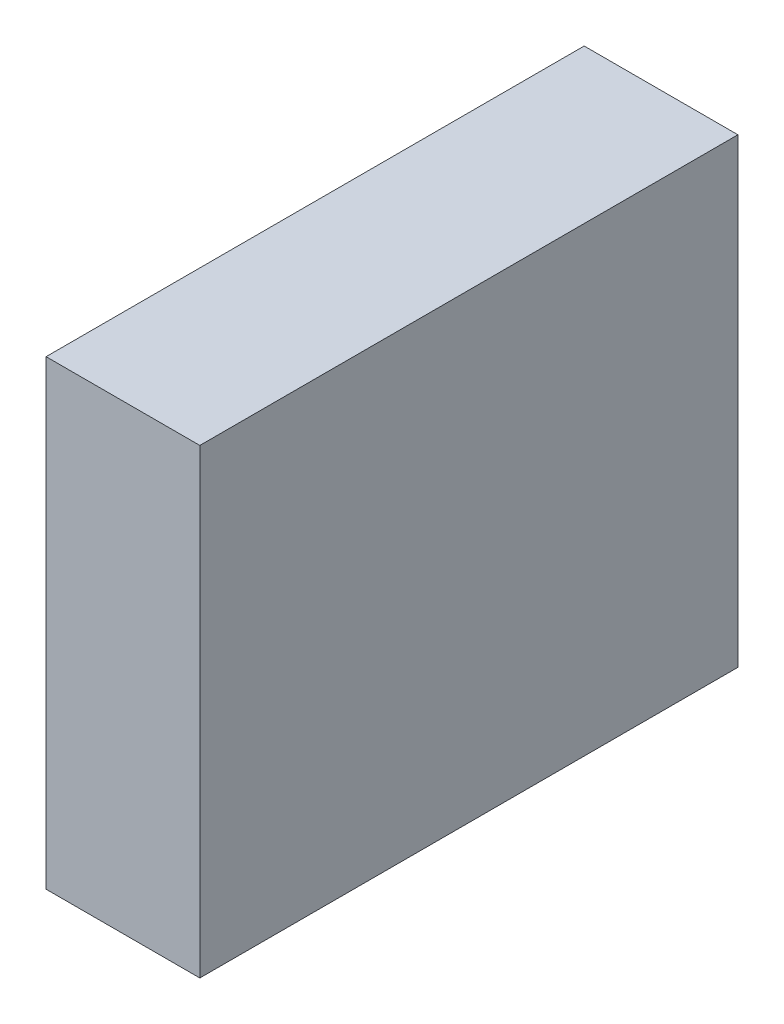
from build123d import *

# Parameters (mm, degrees)
SKETCH1_W           = 44.45
SKETCH1_H           = 38.1
BOSS_EXTRUDE1_DEPTH = 12.7


with BuildPart() as part:
    # Sketch1 → Boss-Extrude1 (new body)
    with BuildSketch(Plane(origin=(0, 0, 0), x_dir=(0, 0, -1), z_dir=(1, 0, 0))):
        with Locations((22.225, 19.05)):
            Rectangle(SKETCH1_W, SKETCH1_H)
    extrude(amount=BOSS_EXTRUDE1_DEPTH)


solid = part.part
